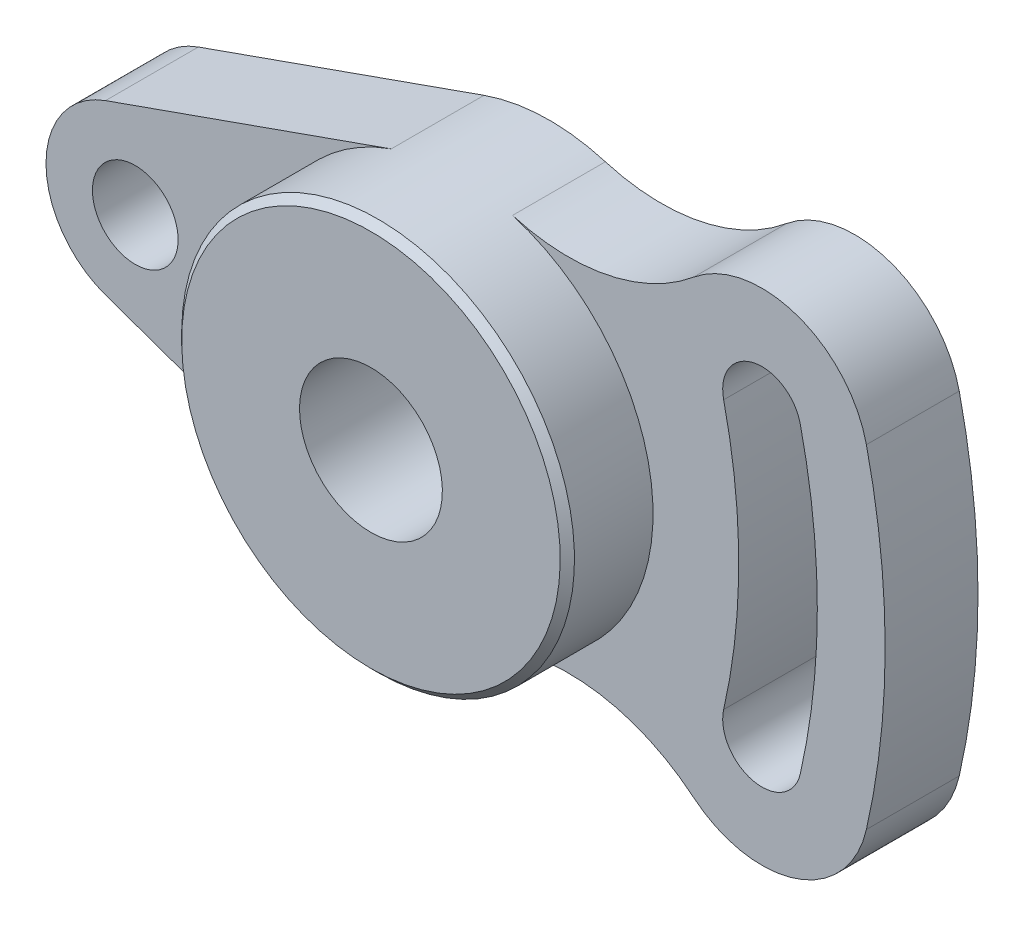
ISO-10303-21;
HEADER;
FILE_DESCRIPTION(('STEP AP214'),'2;1');
FILE_NAME('part.step','',(''),(''),'','','');
FILE_SCHEMA(('AUTOMOTIVE_DESIGN { 1 0 10303 214 1 1 1 1 }'));
ENDSEC;
DATA;
#1=APPLICATION_CONTEXT('core data for automotive mechanical design processes');
#2=APPLICATION_PROTOCOL_DEFINITION('international standard','automotive_design',2000,#1);
#3=PRODUCT_CONTEXT('',#1,'mechanical');
#4=PRODUCT('Part','Part','',(#3));
#5=PRODUCT_RELATED_PRODUCT_CATEGORY('part','',(#4));
#6=PRODUCT_DEFINITION_FORMATION('','',#4);
#7=PRODUCT_DEFINITION_CONTEXT('part definition',#1,'design');
#8=PRODUCT_DEFINITION('design','',#6,#7);
#9=PRODUCT_DEFINITION_SHAPE('','',#8);
#10=(LENGTH_UNIT() NAMED_UNIT(*) SI_UNIT(.MILLI.,.METRE.));
#11=(NAMED_UNIT(*) PLANE_ANGLE_UNIT() SI_UNIT($,.RADIAN.));
#12=(NAMED_UNIT(*) SI_UNIT($,.STERADIAN.) SOLID_ANGLE_UNIT());
#13=UNCERTAINTY_MEASURE_WITH_UNIT(LENGTH_MEASURE(1.E-05),#10,'distance_accuracy_value','');
#14=(GEOMETRIC_REPRESENTATION_CONTEXT(3) GLOBAL_UNCERTAINTY_ASSIGNED_CONTEXT((#13)) GLOBAL_UNIT_ASSIGNED_CONTEXT((#10,
#11,#12)) REPRESENTATION_CONTEXT('',''));
#15=CARTESIAN_POINT('',(0.,0.,0.));
#16=DIRECTION('',(0.,0.,1.));
#17=DIRECTION('',(1.,0.,0.));
#18=AXIS2_PLACEMENT_3D('',#15,#16,#17);
#19=CARTESIAN_POINT('',(87.7496438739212,-20.,13.));
#20=DIRECTION('',(0.,0.,1.));
#21=DIRECTION('',(0.,-1.,0.));
#22=AXIS2_PLACEMENT_3D('',#19,#20,#21);
#23=PLANE('',#22);
#24=CARTESIAN_POINT('',(45.,0.,13.));
#25=DIRECTION('',(0.,0.,1.));
#26=DIRECTION('',(0.,-1.,0.));
#27=AXIS2_PLACEMENT_3D('',#24,#25,#26);
#28=CIRCLE('',#27,27.5);
#29=CARTESIAN_POINT('',(52.8252184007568,-26.3631552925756,13.));
#30=VERTEX_POINT('',#29);
#31=CARTESIAN_POINT('',(52.8252184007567,26.3631552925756,13.));
#32=VERTEX_POINT('',#31);
#33=EDGE_CURVE('E130',#30,#32,#28,.T.);
#34=ORIENTED_EDGE('',*,*,#33,.F.);
#35=CARTESIAN_POINT('',(60.6438540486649,-52.7041332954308,13.));
#36=DIRECTION('',(0.,0.,1.));
#37=DIRECTION('',(0.,-1.,0.));
#38=AXIS2_PLACEMENT_3D('',#35,#36,#37);
#39=CIRCLE('',#38,27.4768663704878);
#40=CARTESIAN_POINT('',(78.1776843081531,-31.548921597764,13.));
#41=VERTEX_POINT('',#40);
#42=EDGE_CURVE('E114',#41,#30,#39,.T.);
#43=ORIENTED_EDGE('',*,*,#42,.F.);
#44=CARTESIAN_POINT('',(87.7496438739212,-20.,13.));
#45=DIRECTION('',(0.,0.,1.));
#46=DIRECTION('',(0.,-1.,0.));
#47=AXIS2_PLACEMENT_3D('',#44,#45,#46);
#48=CIRCLE('',#47,15.);
#49=CARTESIAN_POINT('',(102.374584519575,-23.3333333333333,13.));
#50=VERTEX_POINT('',#49);
#51=EDGE_CURVE('E294',#41,#50,#48,.T.);
#52=ORIENTED_EDGE('',*,*,#51,.T.);
#53=CARTESIAN_POINT('',(0.,0.,13.));
#54=DIRECTION('',(0.,0.,1.));
#55=DIRECTION('',(0.,-1.,0.));
#56=AXIS2_PLACEMENT_3D('',#53,#54,#55);
#57=CIRCLE('',#56,105.);
#58=CARTESIAN_POINT('',(102.374584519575,23.3333333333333,13.));
#59=VERTEX_POINT('',#58);
#60=EDGE_CURVE('E266',#50,#59,#57,.T.);
#61=ORIENTED_EDGE('',*,*,#60,.T.);
#62=CARTESIAN_POINT('',(87.7496438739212,20.,13.));
#63=DIRECTION('',(0.,0.,-1.));
#64=DIRECTION('',(0.,1.,0.));
#65=AXIS2_PLACEMENT_3D('',#62,#63,#64);
#66=CIRCLE('',#65,15.);
#67=CARTESIAN_POINT('',(78.1776843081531,31.548921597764,13.));
#68=VERTEX_POINT('',#67);
#69=EDGE_CURVE('E190',#68,#59,#66,.T.);
#70=ORIENTED_EDGE('',*,*,#69,.F.);
#71=CARTESIAN_POINT('',(60.6438540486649,52.7041332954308,13.));
#72=DIRECTION('',(0.,0.,-1.));
#73=DIRECTION('',(0.,1.,0.));
#74=AXIS2_PLACEMENT_3D('',#71,#72,#73);
#75=CIRCLE('',#74,27.4768663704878);
#76=EDGE_CURVE('E140',#68,#32,#75,.T.);
#77=ORIENTED_EDGE('',*,*,#76,.T.);
#78=EDGE_LOOP('',(#34,#43,#52,#61,#70,#77));
#79=FACE_BOUND('',#78,.T.);
#80=CARTESIAN_POINT('',(0.,0.,13.));
#81=DIRECTION('',(0.,0.,1.));
#82=DIRECTION('',(0.,-1.,0.));
#83=AXIS2_PLACEMENT_3D('',#80,#81,#82);
#84=CIRCLE('',#83,95.5);
#85=CARTESIAN_POINT('',(93.1121221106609,-21.2222222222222,13.));
#86=VERTEX_POINT('',#85);
#87=CARTESIAN_POINT('',(93.1121221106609,21.2222222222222,13.));
#88=VERTEX_POINT('',#87);
#89=EDGE_CURVE('E322',#86,#88,#84,.T.);
#90=ORIENTED_EDGE('',*,*,#89,.F.);
#91=CARTESIAN_POINT('',(87.7496438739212,-20.,13.));
#92=DIRECTION('',(0.,0.,1.));
#93=DIRECTION('',(0.,-1.,0.));
#94=AXIS2_PLACEMENT_3D('',#91,#92,#93);
#95=CIRCLE('',#94,5.5);
#96=CARTESIAN_POINT('',(82.3871656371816,-18.7777777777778,13.));
#97=VERTEX_POINT('',#96);
#98=EDGE_CURVE('E325',#97,#86,#95,.T.);
#99=ORIENTED_EDGE('',*,*,#98,.F.);
#100=CARTESIAN_POINT('',(0.,0.,13.));
#101=DIRECTION('',(0.,0.,1.));
#102=DIRECTION('',(0.,-1.,0.));
#103=AXIS2_PLACEMENT_3D('',#100,#101,#102);
#104=CIRCLE('',#103,84.5);
#105=CARTESIAN_POINT('',(82.3871656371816,18.7777777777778,13.));
#106=VERTEX_POINT('',#105);
#107=EDGE_CURVE('E318',#97,#106,#104,.T.);
#108=ORIENTED_EDGE('',*,*,#107,.T.);
#109=CARTESIAN_POINT('',(87.7496438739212,20.,13.));
#110=DIRECTION('',(0.,0.,-1.));
#111=DIRECTION('',(0.,1.,0.));
#112=AXIS2_PLACEMENT_3D('',#109,#110,#111);
#113=CIRCLE('',#112,5.5);
#114=EDGE_CURVE('E29',#106,#88,#113,.T.);
#115=ORIENTED_EDGE('',*,*,#114,.T.);
#116=EDGE_LOOP('',(#90,#99,#108,#115));
#117=FACE_BOUND('',#116,.T.);
#118=ADVANCED_FACE('F14',(#79,#117),#23,.T.);
#119=CARTESIAN_POINT('',(35.8333333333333,25.9272486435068,13.));
#120=VERTEX_POINT('',#119);
#121=CARTESIAN_POINT('',(35.8333333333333,-25.9272486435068,13.));
#122=VERTEX_POINT('',#121);
#123=EDGE_CURVE('E160',#120,#122,#28,.T.);
#124=ORIENTED_EDGE('',*,*,#123,.F.);
#125=DIRECTION('',(-0.942809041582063,-0.333333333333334,0.));
#126=VECTOR('',#125,1.);
#127=CARTESIAN_POINT('',(35.8333333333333,25.9272486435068,13.));
#128=LINE('',#127,#126);
#129=CARTESIAN_POINT('',(-4.1666666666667,11.7851130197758,13.));
#130=VERTEX_POINT('',#129);
#131=EDGE_CURVE('E180',#120,#130,#128,.T.);
#132=ORIENTED_EDGE('',*,*,#131,.T.);
#133=CARTESIAN_POINT('',(0.,0.,13.));
#134=DIRECTION('',(0.,0.,1.));
#135=DIRECTION('',(0.,-1.,0.));
#136=AXIS2_PLACEMENT_3D('',#133,#134,#135);
#137=CIRCLE('',#136,12.5);
#138=CARTESIAN_POINT('',(-4.1666666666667,-11.7851130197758,13.));
#139=VERTEX_POINT('',#138);
#140=EDGE_CURVE('E171',#130,#139,#137,.T.);
#141=ORIENTED_EDGE('',*,*,#140,.T.);
#142=DIRECTION('',(-0.942809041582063,0.333333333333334,0.));
#143=VECTOR('',#142,1.);
#144=CARTESIAN_POINT('',(35.8333333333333,-25.9272486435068,13.));
#145=LINE('',#144,#143);
#146=EDGE_CURVE('E125',#122,#139,#145,.T.);
#147=ORIENTED_EDGE('',*,*,#146,.F.);
#148=EDGE_LOOP('',(#124,#132,#141,#147));
#149=FACE_BOUND('',#148,.T.);
#150=CARTESIAN_POINT('',(0.,0.,13.));
#151=DIRECTION('',(0.,0.,1.));
#152=DIRECTION('',(0.,-1.,0.));
#153=AXIS2_PLACEMENT_3D('',#150,#151,#152);
#154=CIRCLE('',#153,6.);
#155=CARTESIAN_POINT('',(0.,-6.,13.));
#156=VERTEX_POINT('',#155);
#157=EDGE_CURVE('E145',#156,#156,#154,.T.);
#158=ORIENTED_EDGE('',*,*,#157,.F.);
#159=EDGE_LOOP('',(#158));
#160=FACE_BOUND('',#159,.T.);
#161=ADVANCED_FACE('F214',(#149,#160),#23,.T.);
#162=CARTESIAN_POINT('',(87.7496438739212,-20.,0.));
#163=DIRECTION('',(0.,0.,1.));
#164=DIRECTION('',(0.,-1.,0.));
#165=AXIS2_PLACEMENT_3D('',#162,#163,#164);
#166=PLANE('',#165);
#167=CARTESIAN_POINT('',(45.,0.,0.));
#168=DIRECTION('',(0.,0.,1.));
#169=DIRECTION('',(0.,-1.,0.));
#170=AXIS2_PLACEMENT_3D('',#167,#168,#169);
#171=CIRCLE('',#170,10.);
#172=CARTESIAN_POINT('',(45.,-10.,0.));
#173=VERTEX_POINT('',#172);
#174=EDGE_CURVE('E142',#173,#173,#171,.T.);
#175=ORIENTED_EDGE('',*,*,#174,.T.);
#176=EDGE_LOOP('',(#175));
#177=FACE_BOUND('',#176,.T.);
#178=CARTESIAN_POINT('',(87.7496438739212,-20.,0.));
#179=DIRECTION('',(0.,0.,1.));
#180=DIRECTION('',(0.,-1.,0.));
#181=AXIS2_PLACEMENT_3D('',#178,#179,#180);
#182=CIRCLE('',#181,5.5);
#183=CARTESIAN_POINT('',(82.3871656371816,-18.7777777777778,0.));
#184=VERTEX_POINT('',#183);
#185=CARTESIAN_POINT('',(93.1121221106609,-21.2222222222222,0.));
#186=VERTEX_POINT('',#185);
#187=EDGE_CURVE('E37',#184,#186,#182,.T.);
#188=ORIENTED_EDGE('',*,*,#187,.T.);
#189=CARTESIAN_POINT('',(0.,0.,0.));
#190=DIRECTION('',(0.,0.,1.));
#191=DIRECTION('',(0.,-1.,0.));
#192=AXIS2_PLACEMENT_3D('',#189,#190,#191);
#193=CIRCLE('',#192,95.5);
#194=CARTESIAN_POINT('',(93.1121221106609,21.2222222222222,0.));
#195=VERTEX_POINT('',#194);
#196=EDGE_CURVE('E334',#186,#195,#193,.T.);
#197=ORIENTED_EDGE('',*,*,#196,.T.);
#198=CARTESIAN_POINT('',(87.7496438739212,20.,0.));
#199=DIRECTION('',(0.,0.,-1.));
#200=DIRECTION('',(0.,1.,0.));
#201=AXIS2_PLACEMENT_3D('',#198,#199,#200);
#202=CIRCLE('',#201,5.5);
#203=CARTESIAN_POINT('',(82.3871656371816,18.7777777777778,0.));
#204=VERTEX_POINT('',#203);
#205=EDGE_CURVE('E331',#204,#195,#202,.T.);
#206=ORIENTED_EDGE('',*,*,#205,.F.);
#207=CARTESIAN_POINT('',(0.,0.,0.));
#208=DIRECTION('',(0.,0.,1.));
#209=DIRECTION('',(0.,-1.,0.));
#210=AXIS2_PLACEMENT_3D('',#207,#208,#209);
#211=CIRCLE('',#210,84.5);
#212=EDGE_CURVE('E328',#184,#204,#211,.T.);
#213=ORIENTED_EDGE('',*,*,#212,.F.);
#214=EDGE_LOOP('',(#188,#197,#206,#213));
#215=FACE_BOUND('',#214,.T.);
#216=CARTESIAN_POINT('',(87.7496438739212,-20.,0.));
#217=DIRECTION('',(0.,0.,1.));
#218=DIRECTION('',(0.,-1.,0.));
#219=AXIS2_PLACEMENT_3D('',#216,#217,#218);
#220=CIRCLE('',#219,15.);
#221=CARTESIAN_POINT('',(78.1776843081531,-31.548921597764,0.));
#222=VERTEX_POINT('',#221);
#223=CARTESIAN_POINT('',(102.374584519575,-23.3333333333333,0.));
#224=VERTEX_POINT('',#223);
#225=EDGE_CURVE('E305',#222,#224,#220,.T.);
#226=ORIENTED_EDGE('',*,*,#225,.F.);
#227=CARTESIAN_POINT('',(60.6438540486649,-52.7041332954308,0.));
#228=DIRECTION('',(0.,0.,1.));
#229=DIRECTION('',(0.,-1.,0.));
#230=AXIS2_PLACEMENT_3D('',#227,#228,#229);
#231=CIRCLE('',#230,27.4768663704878);
#232=CARTESIAN_POINT('',(52.8252184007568,-26.3631552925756,0.));
#233=VERTEX_POINT('',#232);
#234=EDGE_CURVE('E292',#222,#233,#231,.T.);
#235=ORIENTED_EDGE('',*,*,#234,.T.);
#236=CARTESIAN_POINT('',(45.,0.,0.));
#237=DIRECTION('',(0.,0.,1.));
#238=DIRECTION('',(0.,-1.,0.));
#239=AXIS2_PLACEMENT_3D('',#236,#237,#238);
#240=CIRCLE('',#239,27.5);
#241=CARTESIAN_POINT('',(35.8333333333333,-25.9272486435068,0.));
#242=VERTEX_POINT('',#241);
#243=EDGE_CURVE('E132',#242,#233,#240,.T.);
#244=ORIENTED_EDGE('',*,*,#243,.F.);
#245=DIRECTION('',(-0.942809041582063,0.333333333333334,0.));
#246=VECTOR('',#245,1.);
#247=CARTESIAN_POINT('',(35.8333333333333,-25.9272486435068,0.));
#248=LINE('',#247,#246);
#249=CARTESIAN_POINT('',(-4.1666666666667,-11.7851130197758,0.));
#250=VERTEX_POINT('',#249);
#251=EDGE_CURVE('E286',#242,#250,#248,.T.);
#252=ORIENTED_EDGE('',*,*,#251,.T.);
#253=CARTESIAN_POINT('',(0.,0.,0.));
#254=DIRECTION('',(0.,0.,1.));
#255=DIRECTION('',(0.,-1.,0.));
#256=AXIS2_PLACEMENT_3D('',#253,#254,#255);
#257=CIRCLE('',#256,12.5);
#258=CARTESIAN_POINT('',(-4.1666666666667,11.7851130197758,0.));
#259=VERTEX_POINT('',#258);
#260=EDGE_CURVE('E284',#259,#250,#257,.T.);
#261=ORIENTED_EDGE('',*,*,#260,.F.);
#262=DIRECTION('',(-0.942809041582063,-0.333333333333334,0.));
#263=VECTOR('',#262,1.);
#264=CARTESIAN_POINT('',(35.8333333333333,25.9272486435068,0.));
#265=LINE('',#264,#263);
#266=CARTESIAN_POINT('',(35.8333333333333,25.9272486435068,0.));
#267=VERTEX_POINT('',#266);
#268=EDGE_CURVE('E276',#267,#259,#265,.T.);
#269=ORIENTED_EDGE('',*,*,#268,.F.);
#270=CARTESIAN_POINT('',(45.,0.,0.));
#271=DIRECTION('',(0.,0.,-1.));
#272=DIRECTION('',(0.,1.,0.));
#273=AXIS2_PLACEMENT_3D('',#270,#271,#272);
#274=CIRCLE('',#273,27.5);
#275=CARTESIAN_POINT('',(52.8252184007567,26.3631552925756,0.));
#276=VERTEX_POINT('',#275);
#277=EDGE_CURVE('E272',#267,#276,#274,.T.);
#278=ORIENTED_EDGE('',*,*,#277,.T.);
#279=CARTESIAN_POINT('',(60.6438540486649,52.7041332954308,0.));
#280=DIRECTION('',(0.,0.,-1.));
#281=DIRECTION('',(0.,1.,0.));
#282=AXIS2_PLACEMENT_3D('',#279,#280,#281);
#283=CIRCLE('',#282,27.4768663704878);
#284=CARTESIAN_POINT('',(78.1776843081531,31.548921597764,0.));
#285=VERTEX_POINT('',#284);
#286=EDGE_CURVE('E268',#285,#276,#283,.T.);
#287=ORIENTED_EDGE('',*,*,#286,.F.);
#288=CARTESIAN_POINT('',(87.7496438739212,20.,0.));
#289=DIRECTION('',(0.,0.,-1.));
#290=DIRECTION('',(0.,1.,0.));
#291=AXIS2_PLACEMENT_3D('',#288,#289,#290);
#292=CIRCLE('',#291,15.);
#293=CARTESIAN_POINT('',(102.374584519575,23.3333333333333,0.));
#294=VERTEX_POINT('',#293);
#295=EDGE_CURVE('E259',#285,#294,#292,.T.);
#296=ORIENTED_EDGE('',*,*,#295,.T.);
#297=CARTESIAN_POINT('',(0.,0.,0.));
#298=DIRECTION('',(0.,0.,1.));
#299=DIRECTION('',(0.,-1.,0.));
#300=AXIS2_PLACEMENT_3D('',#297,#298,#299);
#301=CIRCLE('',#300,105.);
#302=EDGE_CURVE('E304',#224,#294,#301,.T.);
#303=ORIENTED_EDGE('',*,*,#302,.F.);
#304=EDGE_LOOP('',(#226,#235,#244,#252,#261,#269,#278,#287,#296,#303));
#305=FACE_BOUND('',#304,.T.);
#306=CARTESIAN_POINT('',(0.,0.,0.));
#307=DIRECTION('',(0.,0.,1.));
#308=DIRECTION('',(0.,-1.,0.));
#309=AXIS2_PLACEMENT_3D('',#306,#307,#308);
#310=CIRCLE('',#309,6.);
#311=CARTESIAN_POINT('',(0.,-6.,0.));
#312=VERTEX_POINT('',#311);
#313=EDGE_CURVE('E141',#312,#312,#310,.T.);
#314=ORIENTED_EDGE('',*,*,#313,.T.);
#315=EDGE_LOOP('',(#314));
#316=FACE_BOUND('',#315,.T.);
#317=ADVANCED_FACE('F219',(#177,#215,#305,#316),#166,.F.);
#318=CARTESIAN_POINT('',(87.7496438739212,-20.,13.));
#319=DIRECTION('',(0.,0.,-1.));
#320=DIRECTION('',(0.,1.,0.));
#321=AXIS2_PLACEMENT_3D('',#318,#319,#320);
#322=CYLINDRICAL_SURFACE('',#321,15.);
#323=DIRECTION('',(0.,0.,-1.));
#324=VECTOR('',#323,1.);
#325=CARTESIAN_POINT('',(102.374584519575,-23.3333333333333,13.));
#326=LINE('',#325,#324);
#327=EDGE_CURVE('E155',#50,#224,#326,.T.);
#328=ORIENTED_EDGE('',*,*,#327,.F.);
#329=ORIENTED_EDGE('',*,*,#51,.F.);
#330=DIRECTION('',(0.,0.,-1.));
#331=VECTOR('',#330,1.);
#332=CARTESIAN_POINT('',(78.1776843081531,-31.548921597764,13.));
#333=LINE('',#332,#331);
#334=EDGE_CURVE('E120',#41,#222,#333,.T.);
#335=ORIENTED_EDGE('',*,*,#334,.T.);
#336=ORIENTED_EDGE('',*,*,#225,.T.);
#337=EDGE_LOOP('',(#328,#329,#335,#336));
#338=FACE_BOUND('',#337,.T.);
#339=ADVANCED_FACE('F224',(#338),#322,.T.);
#340=CARTESIAN_POINT('',(0.,0.,13.));
#341=DIRECTION('',(0.,0.,-1.));
#342=DIRECTION('',(0.,1.,0.));
#343=AXIS2_PLACEMENT_3D('',#340,#341,#342);
#344=CYLINDRICAL_SURFACE('',#343,105.);
#345=DIRECTION('',(0.,0.,-1.));
#346=VECTOR('',#345,1.);
#347=CARTESIAN_POINT('',(102.374584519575,23.3333333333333,13.));
#348=LINE('',#347,#346);
#349=EDGE_CURVE('E262',#59,#294,#348,.T.);
#350=ORIENTED_EDGE('',*,*,#349,.F.);
#351=ORIENTED_EDGE('',*,*,#60,.F.);
#352=ORIENTED_EDGE('',*,*,#327,.T.);
#353=ORIENTED_EDGE('',*,*,#302,.T.);
#354=EDGE_LOOP('',(#350,#351,#352,#353));
#355=FACE_BOUND('',#354,.T.);
#356=ADVANCED_FACE('F16',(#355),#344,.T.);
#357=CARTESIAN_POINT('',(87.7496438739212,20.,13.));
#358=DIRECTION('',(0.,0.,-1.));
#359=DIRECTION('',(0.,1.,0.));
#360=AXIS2_PLACEMENT_3D('',#357,#358,#359);
#361=CYLINDRICAL_SURFACE('',#360,15.);
#362=DIRECTION('',(0.,0.,-1.));
#363=VECTOR('',#362,1.);
#364=CARTESIAN_POINT('',(78.1776843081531,31.548921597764,13.));
#365=LINE('',#364,#363);
#366=EDGE_CURVE('E186',#68,#285,#365,.T.);
#367=ORIENTED_EDGE('',*,*,#366,.F.);
#368=ORIENTED_EDGE('',*,*,#69,.T.);
#369=ORIENTED_EDGE('',*,*,#349,.T.);
#370=ORIENTED_EDGE('',*,*,#295,.F.);
#371=EDGE_LOOP('',(#367,#368,#369,#370));
#372=FACE_BOUND('',#371,.T.);
#373=ADVANCED_FACE('F248',(#372),#361,.T.);
#374=CARTESIAN_POINT('',(60.6438540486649,52.7041332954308,13.));
#375=DIRECTION('',(0.,0.,-1.));
#376=DIRECTION('',(0.,1.,0.));
#377=AXIS2_PLACEMENT_3D('',#374,#375,#376);
#378=CYLINDRICAL_SURFACE('',#377,27.4768663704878);
#379=DIRECTION('',(0.,0.,-1.));
#380=VECTOR('',#379,1.);
#381=CARTESIAN_POINT('',(52.8252184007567,26.3631552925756,13.));
#382=LINE('',#381,#380);
#383=EDGE_CURVE('E176',#32,#276,#382,.T.);
#384=ORIENTED_EDGE('',*,*,#383,.F.);
#385=ORIENTED_EDGE('',*,*,#76,.F.);
#386=ORIENTED_EDGE('',*,*,#366,.T.);
#387=ORIENTED_EDGE('',*,*,#286,.T.);
#388=EDGE_LOOP('',(#384,#385,#386,#387));
#389=FACE_BOUND('',#388,.T.);
#390=ADVANCED_FACE('F245',(#389),#378,.F.);
#391=CARTESIAN_POINT('',(35.8333333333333,25.9272486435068,13.));
#392=DIRECTION('',(0.333333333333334,-0.942809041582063,0.));
#393=DIRECTION('',(0.942809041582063,0.333333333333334,0.));
#394=AXIS2_PLACEMENT_3D('',#391,#392,#393);
#395=PLANE('',#394);
#396=DIRECTION('',(0.,0.,-1.));
#397=VECTOR('',#396,1.);
#398=CARTESIAN_POINT('',(-4.1666666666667,11.7851130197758,13.));
#399=LINE('',#398,#397);
#400=EDGE_CURVE('E177',#130,#259,#399,.T.);
#401=ORIENTED_EDGE('',*,*,#400,.F.);
#402=ORIENTED_EDGE('',*,*,#131,.F.);
#403=DIRECTION('',(0.,0.,-1.));
#404=VECTOR('',#403,1.);
#405=CARTESIAN_POINT('',(35.8333333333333,25.9272486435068,13.));
#406=LINE('',#405,#404);
#407=EDGE_CURVE('E174',#120,#267,#406,.T.);
#408=ORIENTED_EDGE('',*,*,#407,.T.);
#409=ORIENTED_EDGE('',*,*,#268,.T.);
#410=EDGE_LOOP('',(#401,#402,#408,#409));
#411=FACE_BOUND('',#410,.T.);
#412=ADVANCED_FACE('F241',(#411),#395,.F.);
#413=CARTESIAN_POINT('',(0.,0.,13.));
#414=DIRECTION('',(0.,0.,-1.));
#415=DIRECTION('',(0.,1.,0.));
#416=AXIS2_PLACEMENT_3D('',#413,#414,#415);
#417=CYLINDRICAL_SURFACE('',#416,12.5);
#418=DIRECTION('',(0.,0.,-1.));
#419=VECTOR('',#418,1.);
#420=CARTESIAN_POINT('',(-4.1666666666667,-11.7851130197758,13.));
#421=LINE('',#420,#419);
#422=EDGE_CURVE('E166',#139,#250,#421,.T.);
#423=ORIENTED_EDGE('',*,*,#422,.F.);
#424=ORIENTED_EDGE('',*,*,#140,.F.);
#425=ORIENTED_EDGE('',*,*,#400,.T.);
#426=ORIENTED_EDGE('',*,*,#260,.T.);
#427=EDGE_LOOP('',(#423,#424,#425,#426));
#428=FACE_BOUND('',#427,.T.);
#429=ADVANCED_FACE('F237',(#428),#417,.T.);
#430=CARTESIAN_POINT('',(35.8333333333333,-25.9272486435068,13.));
#431=DIRECTION('',(-0.333333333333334,-0.942809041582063,0.));
#432=DIRECTION('',(0.942809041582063,-0.333333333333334,0.));
#433=AXIS2_PLACEMENT_3D('',#430,#431,#432);
#434=PLANE('',#433);
#435=DIRECTION('',(0.,0.,-1.));
#436=VECTOR('',#435,1.);
#437=CARTESIAN_POINT('',(35.8333333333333,-25.9272486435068,13.));
#438=LINE('',#437,#436);
#439=EDGE_CURVE('E134',#122,#242,#438,.T.);
#440=ORIENTED_EDGE('',*,*,#439,.F.);
#441=ORIENTED_EDGE('',*,*,#146,.T.);
#442=ORIENTED_EDGE('',*,*,#422,.T.);
#443=ORIENTED_EDGE('',*,*,#251,.F.);
#444=EDGE_LOOP('',(#440,#441,#442,#443));
#445=FACE_BOUND('',#444,.T.);
#446=ADVANCED_FACE('F233',(#445),#434,.T.);
#447=CARTESIAN_POINT('',(45.,0.,13.));
#448=DIRECTION('',(0.,0.,-1.));
#449=DIRECTION('',(0.,1.,0.));
#450=AXIS2_PLACEMENT_3D('',#447,#448,#449);
#451=CYLINDRICAL_SURFACE('',#450,27.5);
#452=CARTESIAN_POINT('',(45.,0.,24.));
#453=DIRECTION('',(0.,0.,1.));
#454=DIRECTION('',(0.,-1.,0.));
#455=AXIS2_PLACEMENT_3D('',#452,#453,#454);
#456=CIRCLE('',#455,27.5);
#457=CARTESIAN_POINT('',(45.,-27.5,24.));
#458=VERTEX_POINT('',#457);
#459=EDGE_CURVE('E9',#458,#458,#456,.F.);
#460=ORIENTED_EDGE('',*,*,#459,.T.);
#461=EDGE_LOOP('',(#460));
#462=FACE_BOUND('',#461,.T.);
#463=DIRECTION('',(0.,0.,-1.));
#464=VECTOR('',#463,1.);
#465=CARTESIAN_POINT('',(52.8252184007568,-26.3631552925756,13.));
#466=LINE('',#465,#464);
#467=EDGE_CURVE('E118',#30,#233,#466,.T.);
#468=ORIENTED_EDGE('',*,*,#467,.F.);
#469=ORIENTED_EDGE('',*,*,#33,.T.);
#470=ORIENTED_EDGE('',*,*,#383,.T.);
#471=ORIENTED_EDGE('',*,*,#277,.F.);
#472=ORIENTED_EDGE('',*,*,#407,.F.);
#473=ORIENTED_EDGE('',*,*,#123,.T.);
#474=ORIENTED_EDGE('',*,*,#439,.T.);
#475=ORIENTED_EDGE('',*,*,#243,.T.);
#476=EDGE_LOOP('',(#468,#469,#470,#471,#472,#473,#474,#475));
#477=FACE_BOUND('',#476,.T.);
#478=ADVANCED_FACE('F129',(#462,#477),#451,.T.);
#479=CARTESIAN_POINT('',(60.6438540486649,-52.7041332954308,13.));
#480=DIRECTION('',(0.,0.,-1.));
#481=DIRECTION('',(0.,1.,0.));
#482=AXIS2_PLACEMENT_3D('',#479,#480,#481);
#483=CYLINDRICAL_SURFACE('',#482,27.4768663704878);
#484=ORIENTED_EDGE('',*,*,#42,.T.);
#485=ORIENTED_EDGE('',*,*,#467,.T.);
#486=ORIENTED_EDGE('',*,*,#234,.F.);
#487=ORIENTED_EDGE('',*,*,#334,.F.);
#488=EDGE_LOOP('',(#484,#485,#486,#487));
#489=FACE_BOUND('',#488,.T.);
#490=ADVANCED_FACE('F116',(#489),#483,.F.);
#491=CARTESIAN_POINT('',(87.7496438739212,-20.,13.));
#492=DIRECTION('',(0.,0.,-1.));
#493=DIRECTION('',(0.,1.,0.));
#494=AXIS2_PLACEMENT_3D('',#491,#492,#493);
#495=CYLINDRICAL_SURFACE('',#494,5.5);
#496=DIRECTION('',(0.,0.,-1.));
#497=VECTOR('',#496,1.);
#498=CARTESIAN_POINT('',(93.1121221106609,-21.2222222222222,13.));
#499=LINE('',#498,#497);
#500=EDGE_CURVE('E306',#86,#186,#499,.T.);
#501=ORIENTED_EDGE('',*,*,#500,.T.);
#502=ORIENTED_EDGE('',*,*,#187,.F.);
#503=DIRECTION('',(0.,0.,-1.));
#504=VECTOR('',#503,1.);
#505=CARTESIAN_POINT('',(82.3871656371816,-18.7777777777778,13.));
#506=LINE('',#505,#504);
#507=EDGE_CURVE('E316',#97,#184,#506,.T.);
#508=ORIENTED_EDGE('',*,*,#507,.F.);
#509=ORIENTED_EDGE('',*,*,#98,.T.);
#510=EDGE_LOOP('',(#501,#502,#508,#509));
#511=FACE_BOUND('',#510,.T.);
#512=ADVANCED_FACE('F230',(#511),#495,.F.);
#513=CARTESIAN_POINT('',(0.,0.,13.));
#514=DIRECTION('',(0.,0.,-1.));
#515=DIRECTION('',(0.,1.,0.));
#516=AXIS2_PLACEMENT_3D('',#513,#514,#515);
#517=CYLINDRICAL_SURFACE('',#516,95.5);
#518=DIRECTION('',(0.,0.,-1.));
#519=VECTOR('',#518,1.);
#520=CARTESIAN_POINT('',(93.1121221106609,21.2222222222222,13.));
#521=LINE('',#520,#519);
#522=EDGE_CURVE('E312',#88,#195,#521,.T.);
#523=ORIENTED_EDGE('',*,*,#522,.T.);
#524=ORIENTED_EDGE('',*,*,#196,.F.);
#525=ORIENTED_EDGE('',*,*,#500,.F.);
#526=ORIENTED_EDGE('',*,*,#89,.T.);
#527=EDGE_LOOP('',(#523,#524,#525,#526));
#528=FACE_BOUND('',#527,.T.);
#529=ADVANCED_FACE('F360',(#528),#517,.F.);
#530=CARTESIAN_POINT('',(87.7496438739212,20.,13.));
#531=DIRECTION('',(0.,0.,-1.));
#532=DIRECTION('',(0.,1.,0.));
#533=AXIS2_PLACEMENT_3D('',#530,#531,#532);
#534=CYLINDRICAL_SURFACE('',#533,5.5);
#535=DIRECTION('',(0.,0.,-1.));
#536=VECTOR('',#535,1.);
#537=CARTESIAN_POINT('',(82.3871656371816,18.7777777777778,13.));
#538=LINE('',#537,#536);
#539=EDGE_CURVE('E314',#106,#204,#538,.T.);
#540=ORIENTED_EDGE('',*,*,#539,.T.);
#541=ORIENTED_EDGE('',*,*,#205,.T.);
#542=ORIENTED_EDGE('',*,*,#522,.F.);
#543=ORIENTED_EDGE('',*,*,#114,.F.);
#544=EDGE_LOOP('',(#540,#541,#542,#543));
#545=FACE_BOUND('',#544,.T.);
#546=ADVANCED_FACE('F361',(#545),#534,.F.);
#547=CARTESIAN_POINT('',(0.,0.,13.));
#548=DIRECTION('',(0.,0.,-1.));
#549=DIRECTION('',(0.,1.,0.));
#550=AXIS2_PLACEMENT_3D('',#547,#548,#549);
#551=CYLINDRICAL_SURFACE('',#550,84.5);
#552=ORIENTED_EDGE('',*,*,#107,.F.);
#553=ORIENTED_EDGE('',*,*,#507,.T.);
#554=ORIENTED_EDGE('',*,*,#212,.T.);
#555=ORIENTED_EDGE('',*,*,#539,.F.);
#556=EDGE_LOOP('',(#552,#553,#554,#555));
#557=FACE_BOUND('',#556,.T.);
#558=ADVANCED_FACE('F343',(#557),#551,.T.);
#559=CARTESIAN_POINT('',(0.,0.,13.));
#560=DIRECTION('',(0.,0.,-1.));
#561=DIRECTION('',(0.,1.,0.));
#562=AXIS2_PLACEMENT_3D('',#559,#560,#561);
#563=CYLINDRICAL_SURFACE('',#562,6.);
#564=ORIENTED_EDGE('',*,*,#157,.T.);
#565=EDGE_LOOP('',(#564));
#566=FACE_BOUND('',#565,.T.);
#567=ORIENTED_EDGE('',*,*,#313,.F.);
#568=EDGE_LOOP('',(#567));
#569=FACE_BOUND('',#568,.T.);
#570=ADVANCED_FACE('F209',(#566,#569),#563,.F.);
#571=CARTESIAN_POINT('',(45.,0.,25.));
#572=DIRECTION('',(0.,0.,1.));
#573=DIRECTION('',(0.,-1.,0.));
#574=AXIS2_PLACEMENT_3D('',#571,#572,#573);
#575=PLANE('',#574);
#576=CARTESIAN_POINT('',(45.,0.,25.));
#577=DIRECTION('',(0.,0.,1.));
#578=DIRECTION('',(0.,-1.,0.));
#579=AXIS2_PLACEMENT_3D('',#576,#577,#578);
#580=CIRCLE('',#579,10.);
#581=CARTESIAN_POINT('',(45.,-10.,25.));
#582=VERTEX_POINT('',#581);
#583=EDGE_CURVE('E148',#582,#582,#580,.T.);
#584=ORIENTED_EDGE('',*,*,#583,.F.);
#585=EDGE_LOOP('',(#584));
#586=FACE_BOUND('',#585,.T.);
#587=CARTESIAN_POINT('',(45.,0.,25.));
#588=DIRECTION('',(0.,0.,1.));
#589=DIRECTION('',(0.,-1.,0.));
#590=AXIS2_PLACEMENT_3D('',#587,#588,#589);
#591=CIRCLE('',#590,26.5);
#592=CARTESIAN_POINT('',(45.,-26.5,25.));
#593=VERTEX_POINT('',#592);
#594=EDGE_CURVE('E22',#593,#593,#591,.T.);
#595=ORIENTED_EDGE('',*,*,#594,.T.);
#596=EDGE_LOOP('',(#595));
#597=FACE_BOUND('',#596,.T.);
#598=ADVANCED_FACE('F195',(#586,#597),#575,.T.);
#599=CARTESIAN_POINT('',(45.,0.,25.));
#600=DIRECTION('',(0.,0.,-1.));
#601=DIRECTION('',(0.,1.,0.));
#602=AXIS2_PLACEMENT_3D('',#599,#600,#601);
#603=CONICAL_SURFACE('',#602,26.5,0.785398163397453);
#604=ORIENTED_EDGE('',*,*,#459,.F.);
#605=EDGE_LOOP('',(#604));
#606=FACE_BOUND('',#605,.T.);
#607=ORIENTED_EDGE('',*,*,#594,.F.);
#608=EDGE_LOOP('',(#607));
#609=FACE_BOUND('',#608,.T.);
#610=ADVANCED_FACE('F197',(#606,#609),#603,.T.);
#611=CARTESIAN_POINT('',(45.,0.,-2.50000000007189E-05));
#612=DIRECTION('',(0.,0.,1.));
#613=DIRECTION('',(0.,-1.,0.));
#614=AXIS2_PLACEMENT_3D('',#611,#612,#613);
#615=CYLINDRICAL_SURFACE('',#614,10.);
#616=ORIENTED_EDGE('',*,*,#583,.T.);
#617=EDGE_LOOP('',(#616));
#618=FACE_BOUND('',#617,.T.);
#619=ORIENTED_EDGE('',*,*,#174,.F.);
#620=EDGE_LOOP('',(#619));
#621=FACE_BOUND('',#620,.T.);
#622=ADVANCED_FACE('F199',(#618,#621),#615,.F.);
#623=CLOSED_SHELL('',(#118,#161,#317,#339,#356,#373,#390,#412,#429,#446,#478,#490,#512,#529,
#546,#558,#570,#598,#610,#622));
#624=MANIFOLD_SOLID_BREP('B1',#623);
#625=ADVANCED_BREP_SHAPE_REPRESENTATION('',(#18,#624),#14);
#626=SHAPE_DEFINITION_REPRESENTATION(#9,#625);
ENDSEC;
END-ISO-10303-21;
